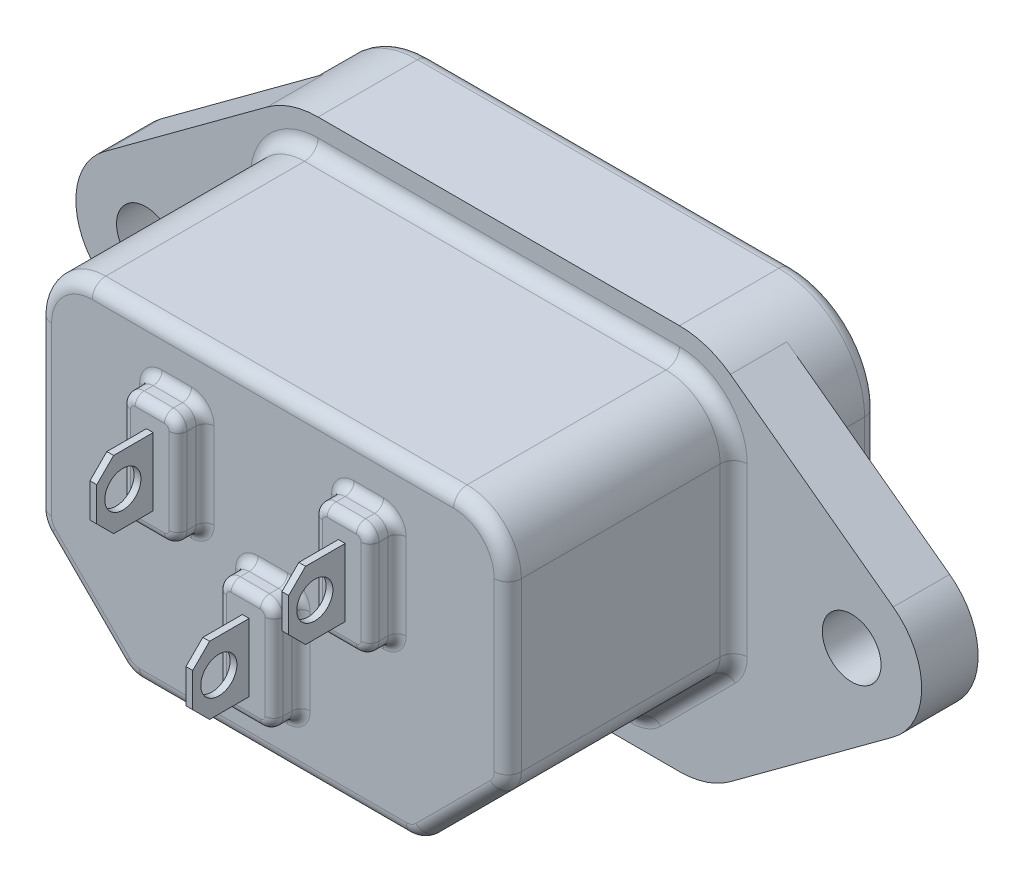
from build123d import *

# Parameters (mm, degrees)
BASE_EXTRUDE_DEPTH       = 3.175
BOSS_EXTRUDE1_START      = 3.175
SKETCH2_R                = 1.651
BOSS_EXTRUDE1_DEPTH      = 3.175
BOSS_EXTRUDE2_DEPTH      = 12.7
FILLET1_R                = 1.524
FILLET2_R                = 0.762
FILLET3_R                = 0.762
CUT_EXTRUDE1_DEPTH       = 16.891
FILLET4_R                = 0.762
FILLET5_R                = 0.762
BOSS_EXTRUDE3_DEPTH      = 1.524
FILLET6_R                = 0.508
BOSS_EXTRUDE4_DEPTH      = 3.175
BOSS_EXTRUDE4_DEPTH_BACK = 19.05
SKETCH6_W                = 1.905
SKETCH6_H                = 3.81
CUT_EXTRUDE2_START       = -3.175
CUT_EXTRUDE2_DEPTH       = 3.175
SKETCH8_R                = 1.016
CUT_EXTRUDE3_DEPTH       = 50.878764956
CUT_EXTRUDE4_START       = -10.16
CUT_EXTRUDE4_DEPTH       = 10.16


with BuildPart() as part:
    # Sketch1 → Base-Extrude (new body)
    with BuildSketch(Plane.XY):
        with BuildLine():
            Line((-54.229, 34.671), (-33.909, 34.671))
            ThreePointArc((-33.909, 34.671), (-30.496502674, 33.257497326), (-29.083, 29.845))
            Line((-29.083, 29.845), (-29.083, 17.78))
            ThreePointArc((-29.083, 17.78), (-30.496502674, 14.367502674), (-33.909, 12.954))
            Line((-33.909, 12.954), (-54.229, 12.954))
            ThreePointArc((-54.229, 12.954), (-57.641497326, 14.367502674), (-59.055, 17.78))
            Line((-59.055, 17.78), (-59.055, 29.845))
            ThreePointArc((-59.055, 29.845), (-57.641497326, 33.257497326), (-54.229, 34.671))
        make_face()
    extrude(amount=-BASE_EXTRUDE_DEPTH)

    # Sketch2 → Boss-Extrude1 (add)
    with BuildSketch(Plane.XY.offset(BOSS_EXTRUDE1_START)):
        with BuildLine():
            Line((-54.229, 12.954), (-33.909, 12.954))
            ThreePointArc((-33.909, 12.954), (-32.402074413, 13.195302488), (-31.045842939, 13.895079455))
            Line((-31.045842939, 13.895079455), (-21.889516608, 20.643222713))
            ThreePointArc((-21.889516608, 20.643222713), (-20.28825, 23.8125), (-21.889516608, 26.981777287))
            Line((-21.889516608, 26.981777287), (-31.045842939, 33.729920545))
            ThreePointArc((-31.045842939, 33.729920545), (-32.402074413, 34.429697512), (-33.909, 34.671))
            Line((-33.909, 34.671), (-54.229, 34.671))
            ThreePointArc((-54.229, 34.671), (-55.735925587, 34.429697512), (-57.092157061, 33.729920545))
            Line((-57.092157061, 33.729920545), (-66.248483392, 26.981777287))
            ThreePointArc((-66.248483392, 26.981777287), (-67.84975, 23.8125), (-66.248483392, 20.643222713))
            Line((-66.248483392, 20.643222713), (-57.092157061, 13.895079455))
            ThreePointArc((-57.092157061, 13.895079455), (-55.735925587, 13.195302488), (-54.229, 12.954))
        make_face()
        with Locations((-63.91275, 23.8125)):
            Circle(SKETCH2_R, mode=Mode.SUBTRACT)
        with Locations((-24.22525, 23.8125)):
            Circle(SKETCH2_R, mode=Mode.SUBTRACT)
    extrude(amount=-BOSS_EXTRUDE1_DEPTH)

    # Sketch3 → Boss-Extrude2 (add)
    with BuildSketch(Plane.XY.offset(3.175)):
        with BuildLine():
            Line((-30.861, 19.812), (-35.941, 14.732))
            Line((-35.941, 14.732), (-52.197, 14.732))
            Line((-52.197, 14.732), (-57.277, 19.812))
            Line((-57.277, 19.812), (-57.277, 29.845))
            ThreePointArc((-57.277, 29.845), (-56.384261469, 32.000261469), (-54.229, 32.893))
            Line((-54.229, 32.893), (-33.909, 32.893))
            ThreePointArc((-33.909, 32.893), (-31.753738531, 32.000261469), (-30.861, 29.845))
            Line((-30.861, 29.845), (-30.861, 19.812))
        make_face()
    extrude(amount=BOSS_EXTRUDE2_DEPTH)

    # Fillet1
    fillet1_edges = [part.edges().sort_by_distance(p)[0] for p in [
        (-57.277, 19.812, 9.525),
        (-52.197, 14.732, 9.525),
        (-35.941, 14.732, 9.525),
        (-30.861, 19.812, 9.525),
    ]]
    fillet(fillet1_edges, radius=FILLET1_R)

    # Fillet2
    fillet2_edges = [part.edges().sort_by_distance(p)[0] for p in [
        (-56.384261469, 32.000261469, 3.175),
        (-31.753738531, 32.000261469, 3.175),
        (-44.069, 32.893, 3.175),
        (-30.861, 25.144130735, 3.175),
        (-33.401, 17.272, 3.175),
        (-44.069, 14.732, 3.175),
        (-54.737, 17.272, 3.175),
        (-57.277, 25.144130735, 3.175),
        (-30.977007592, 19.860051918, 3.175),
        (-35.989051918, 14.848007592, 3.175),
        (-52.148948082, 14.848007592, 3.175),
        (-57.160992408, 19.860051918, 3.175),
    ]]
    fillet(fillet2_edges, radius=FILLET2_R)

    # Fillet3
    fillet3_edges = [part.edges().sort_by_distance(p)[0] for p in [
        (-57.641497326, 14.367502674, -3.175),
        (-44.069, 12.954, -3.175),
        (-30.496502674, 14.367502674, -3.175),
        (-29.083, 23.8125, -3.175),
        (-30.496502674, 33.257497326, -3.175),
        (-44.069, 34.671, -3.175),
        (-57.641497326, 33.257497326, -3.175),
        (-30.861, 25.144130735, 15.875),
        (-59.055, 23.8125, -3.175),
        (-44.069, 32.893, 15.875),
        (-56.384261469, 32.000261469, 15.875),
        (-31.753738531, 32.000261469, 15.875),
        (-33.401, 17.272, 15.875),
        (-57.277, 25.144130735, 15.875),
        (-54.737, 17.272, 15.875),
        (-44.069, 14.732, 15.875),
        (-57.160992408, 19.860051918, 15.875),
        (-52.148948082, 14.848007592, 15.875),
        (-35.989051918, 14.848007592, 15.875),
        (-30.977007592, 19.860051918, 15.875),
    ]]
    fillet(fillet3_edges, radius=FILLET3_R)

    # Sketch4 → Cut-Extrude1 (cut)
    with BuildSketch(Plane(origin=(0, 0, -3.175), x_dir=(-1, 0, 0), z_dir=(0, 0, -1))):
        with BuildLine():
            Line((55.499, 20.548471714), (51.460528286, 16.51))
            Line((51.460528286, 16.51), (36.677471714, 16.51))
            Line((36.677471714, 16.51), (32.639, 20.548471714))
            Line((32.639, 20.548471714), (32.639, 29.845))
            ThreePointArc((32.639, 29.845), (33.010974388, 30.743025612), (33.909, 31.115))
            Line((33.909, 31.115), (54.229, 31.115))
            ThreePointArc((54.229, 31.115), (55.127025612, 30.743025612), (55.499, 29.845))
            Line((55.499, 29.845), (55.499, 20.548471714))
        make_face()
    extrude(amount=-CUT_EXTRUDE1_DEPTH, mode=Mode.SUBTRACT)

    # Fillet4
    fillet4_edges = [part.edges().sort_by_distance(p)[0] for p in [
        (-55.499, 20.548471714, 5.2705),
        (-51.460528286, 16.51, 5.2705),
        (-36.677471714, 16.51, 5.2705),
        (-32.639, 20.548471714, 5.2705),
        (-33.010974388, 30.743025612, 13.716),
        (-55.127025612, 30.743025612, 13.716),
        (-55.499, 25.196735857, 13.716),
        (-53.479764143, 18.529235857, 13.716),
        (-44.069, 16.51, 13.716),
        (-34.658235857, 18.529235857, 13.716),
        (-32.639, 25.196735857, 13.716),
        (-44.069, 31.115, 13.716),
    ]]
    fillet(fillet4_edges, radius=FILLET4_R)

    # Fillet5
    fillet5_edges = [part.edges().sort_by_distance(p)[0] for p in [
        (-55.499, 25.354551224, -3.175),
        (-44.069, 31.115, -3.175),
        (-55.127025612, 30.743025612, -3.175),
        (-33.010974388, 30.743025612, -3.175),
        (-34.658235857, 18.529235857, -3.175),
        (-32.639, 25.354551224, -3.175),
        (-44.069, 16.51, -3.175),
        (-53.479764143, 18.529235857, -3.175),
        (-32.697003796, 20.572497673, -3.175),
        (-36.701497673, 16.568003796, -3.175),
        (-51.436502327, 16.568003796, -3.175),
        (-55.440996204, 20.572497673, -3.175),
    ]]
    fillet(fillet5_edges, radius=FILLET5_R)

    # Sketch5 → Boss-Extrude3 (add)
    with BuildSketch(Plane.XY.offset(15.875)):
        with BuildLine():
            Line((-50.292, 30.1625), (-48.641, 30.1625))
            ThreePointArc((-48.641, 30.1625), (-48.102184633, 29.939315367), (-47.879, 29.4005))
            Line((-47.879, 29.4005), (-47.879, 24.5745))
            ThreePointArc((-47.879, 24.5745), (-48.102184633, 24.035684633), (-48.641, 23.8125))
            Line((-48.641, 23.8125), (-50.292, 23.8125))
            ThreePointArc((-50.292, 23.8125), (-50.830815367, 24.035684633), (-51.054, 24.5745))
            Line((-51.054, 24.5745), (-51.054, 29.4005))
            ThreePointArc((-51.054, 29.4005), (-50.830815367, 29.939315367), (-50.292, 30.1625))
        make_face()
        with BuildLine():
            Line((-37.846, 30.1625), (-39.497, 30.1625))
            ThreePointArc((-39.497, 30.1625), (-40.035815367, 29.939315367), (-40.259, 29.4005))
            Line((-40.259, 29.4005), (-40.259, 24.5745))
            ThreePointArc((-40.259, 24.5745), (-40.035815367, 24.035684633), (-39.497, 23.8125))
            Line((-39.497, 23.8125), (-37.846, 23.8125))
            ThreePointArc((-37.846, 23.8125), (-37.307184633, 24.035684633), (-37.084, 24.5745))
            Line((-37.084, 24.5745), (-37.084, 29.4005))
            ThreePointArc((-37.084, 29.4005), (-37.307184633, 29.939315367), (-37.846, 30.1625))
        make_face()
        with BuildLine():
            Line((-43.2435, 23.8125), (-44.8945, 23.8125))
            ThreePointArc((-44.8945, 23.8125), (-45.433315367, 23.589315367), (-45.6565, 23.0505))
            Line((-45.6565, 23.0505), (-45.6565, 18.2245))
            ThreePointArc((-45.6565, 18.2245), (-45.433315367, 17.685684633), (-44.8945, 17.4625))
            Line((-44.8945, 17.4625), (-43.2435, 17.4625))
            ThreePointArc((-43.2435, 17.4625), (-42.704684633, 17.685684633), (-42.4815, 18.2245))
            Line((-42.4815, 18.2245), (-42.4815, 23.0505))
            ThreePointArc((-42.4815, 23.0505), (-42.704684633, 23.589315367), (-43.2435, 23.8125))
        make_face()
    extrude(amount=BOSS_EXTRUDE3_DEPTH)

    # Fillet6
    fillet6_edges = [part.edges().sort_by_distance(p)[0] for p in [
        (-42.704684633, 17.685684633, 15.875),
        (-42.4815, 20.6375, 17.399),
        (-42.704684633, 23.589315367, 17.399),
        (-44.069, 23.8125, 15.875),
        (-45.433315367, 23.589315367, 17.399),
        (-45.6565, 20.6375, 15.875),
        (-45.433315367, 17.685684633, 17.399),
        (-44.069, 17.4625, 15.875),
        (-42.704684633, 17.685684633, 17.399),
        (-44.069, 23.8125, 17.399),
        (-45.6565, 20.6375, 17.399),
        (-44.069, 17.4625, 17.399),
        (-45.433315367, 17.685684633, 15.875),
        (-45.433315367, 23.589315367, 15.875),
        (-42.704684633, 23.589315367, 15.875),
        (-42.4815, 20.6375, 15.875),
        (-48.102184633, 24.035684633, 17.399),
        (-47.879, 26.9875, 15.875),
        (-48.102184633, 29.939315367, 15.875),
        (-49.4665, 30.1625, 17.399),
        (-50.830815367, 29.939315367, 17.399),
        (-51.054, 26.9875, 15.875),
        (-50.830815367, 24.035684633, 17.399),
        (-49.4665, 23.8125, 17.399),
        (-47.879, 26.9875, 17.399),
        (-48.102184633, 29.939315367, 17.399),
        (-51.054, 26.9875, 17.399),
        (-48.102184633, 24.035684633, 15.875),
        (-49.4665, 23.8125, 15.875),
        (-50.830815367, 24.035684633, 15.875),
        (-50.830815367, 29.939315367, 15.875),
        (-49.4665, 30.1625, 15.875),
        (-40.035815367, 24.035684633, 15.875),
        (-38.6715, 23.8125, 15.875),
        (-37.307184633, 24.035684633, 15.875),
        (-37.084, 26.9875, 17.399),
        (-37.307184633, 29.939315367, 15.875),
        (-38.6715, 30.1625, 15.875),
        (-40.035815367, 29.939315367, 17.399),
        (-40.259, 26.9875, 17.399),
        (-40.035815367, 24.035684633, 17.399),
        (-38.6715, 23.8125, 17.399),
        (-37.307184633, 24.035684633, 17.399),
        (-37.307184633, 29.939315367, 17.399),
        (-38.6715, 30.1625, 17.399),
        (-40.259, 26.9875, 15.875),
        (-40.035815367, 29.939315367, 15.875),
        (-37.084, 26.9875, 15.875),
    ]]
    fillet(fillet6_edges, radius=FILLET6_R)

    # Sketch6 → Boss-Extrude4 (add, two sides: drawn at the far end of the back side and taken through both)
    with BuildSketch(Plane.XY.offset(17.399).offset(-BOSS_EXTRUDE4_DEPTH_BACK)):
        with Locations((-38.6715, 26.9875)):
            Rectangle(SKETCH6_W, SKETCH6_H)
        with Locations((-49.4665, 26.9875)):
            Rectangle(SKETCH6_W, SKETCH6_H)
        with Locations((-44.069, 20.6375)):
            Rectangle(SKETCH6_W, SKETCH6_H)
    extrude(amount=BOSS_EXTRUDE4_DEPTH + BOSS_EXTRUDE4_DEPTH_BACK)

    # Sketch7 → Cut-Extrude2 (cut)
    with BuildSketch(Plane.XY.offset(20.574).offset(CUT_EXTRUDE2_START)):
        with BuildLine():
            Line((-43.8785, 17.9705), (-43.2435, 17.9705))
            ThreePointArc((-43.2435, 17.9705), (-43.063894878, 18.044894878), (-42.9895, 18.2245))
            Line((-42.9895, 18.2245), (-42.9895, 23.0505))
            ThreePointArc((-42.9895, 23.0505), (-43.063894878, 23.230105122), (-43.2435, 23.3045))
            Line((-43.2435, 23.3045), (-43.8785, 23.3045))
            Line((-43.8785, 23.3045), (-43.8785, 17.9705))
        make_face()
        with BuildLine():
            Line((-38.862, 29.6545), (-38.862, 24.3205))
            Line((-38.862, 24.3205), (-39.497, 24.3205))
            ThreePointArc((-39.497, 24.3205), (-39.676605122, 24.394894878), (-39.751, 24.5745))
            Line((-39.751, 24.5745), (-39.751, 29.4005))
            ThreePointArc((-39.751, 29.4005), (-39.676605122, 29.580105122), (-39.497, 29.6545))
            Line((-39.497, 29.6545), (-38.862, 29.6545))
        make_face()
        with BuildLine():
            Line((-49.657, 24.3205), (-49.657, 29.6545))
            Line((-49.657, 29.6545), (-50.292, 29.6545))
            ThreePointArc((-50.292, 29.6545), (-50.471605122, 29.580105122), (-50.546, 29.4005))
            Line((-50.546, 29.4005), (-50.546, 24.5745))
            ThreePointArc((-50.546, 24.5745), (-50.471605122, 24.394894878), (-50.292, 24.3205))
            Line((-50.292, 24.3205), (-49.657, 24.3205))
        make_face()
        with BuildLine():
            Line((-44.2595, 23.3045), (-44.2595, 17.9705))
            Line((-44.2595, 17.9705), (-44.8945, 17.9705))
            ThreePointArc((-44.8945, 17.9705), (-45.074105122, 18.044894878), (-45.1485, 18.2245))
            Line((-45.1485, 18.2245), (-45.1485, 23.0505))
            ThreePointArc((-45.1485, 23.0505), (-45.074105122, 23.230105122), (-44.8945, 23.3045))
            Line((-44.8945, 23.3045), (-44.2595, 23.3045))
        make_face()
        with BuildLine():
            Line((-38.481, 24.3205), (-38.481, 29.6545))
            Line((-38.481, 29.6545), (-37.846, 29.6545))
            ThreePointArc((-37.846, 29.6545), (-37.666394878, 29.580105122), (-37.592, 29.4005))
            Line((-37.592, 29.4005), (-37.592, 24.5745))
            ThreePointArc((-37.592, 24.5745), (-37.666394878, 24.394894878), (-37.846, 24.3205))
            Line((-37.846, 24.3205), (-38.481, 24.3205))
        make_face()
        with BuildLine():
            Line((-49.276, 29.6545), (-49.276, 24.3205))
            Line((-49.276, 24.3205), (-48.641, 24.3205))
            ThreePointArc((-48.641, 24.3205), (-48.461394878, 24.394894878), (-48.387, 24.5745))
            Line((-48.387, 24.5745), (-48.387, 29.4005))
            ThreePointArc((-48.387, 29.4005), (-48.461394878, 29.580105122), (-48.641, 29.6545))
            Line((-48.641, 29.6545), (-49.276, 29.6545))
        make_face()
    extrude(amount=CUT_EXTRUDE2_DEPTH, mode=Mode.SUBTRACT)

    # Sketch8 → Cut-Extrude3 (cut, through all)
    with BuildSketch(Plane(origin=(-38.481, 0, 0), x_dir=(0, 0, -1), z_dir=(1, 0, 0))):
        with Locations((-19.106561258, 26.9875)):
            Circle(SKETCH8_R)
        with Locations((-19.106561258, 20.6375)):
            Circle(SKETCH8_R)
        Polygon((-17.399, 24.3205), (-21.336, 24.3205), (-21.336, 29.6545), (-17.399, 29.6545), (-17.399, 28.8925), (-19.625915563, 28.8925), (-20.574, 27.944415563), (-20.574, 26.030584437), (-19.625915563, 25.0825), (-17.399, 25.0825), align=None)
        Polygon((-21.336, 23.3045), (-17.399, 23.3045), (-17.399, 22.5425), (-19.625915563, 22.5425), (-20.574, 21.594415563), (-20.574, 19.680584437), (-19.625915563, 18.7325), (-17.399, 18.7325), (-17.399, 17.9705), (-21.336, 17.9705), align=None)
    extrude(amount=-CUT_EXTRUDE3_DEPTH, mode=Mode.SUBTRACT)

    # Sketch9 → Cut-Extrude4 (cut)
    with BuildSketch(Plane(origin=(0, 28.8925, 0), x_dir=(-1, 0, 0), z_dir=(0, 1, 0)).offset(CUT_EXTRUDE4_START)):
        Polygon((50.865682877, 0.829695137), (50.646744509, 0.829695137), (49.4665, -2.413), (48.286255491, 0.829695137), (45.249244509, 0.829695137), (44.069, -2.413), (42.888755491, 0.829695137), (39.851744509, 0.829695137), (38.6715, -2.413), (37.491255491, 0.829695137), (37.272317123, 0.829695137), (37.272317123, -2.786920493), (50.865682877, -2.786920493), align=None)
    extrude(amount=CUT_EXTRUDE4_DEPTH, mode=Mode.SUBTRACT)


solid = part.part
